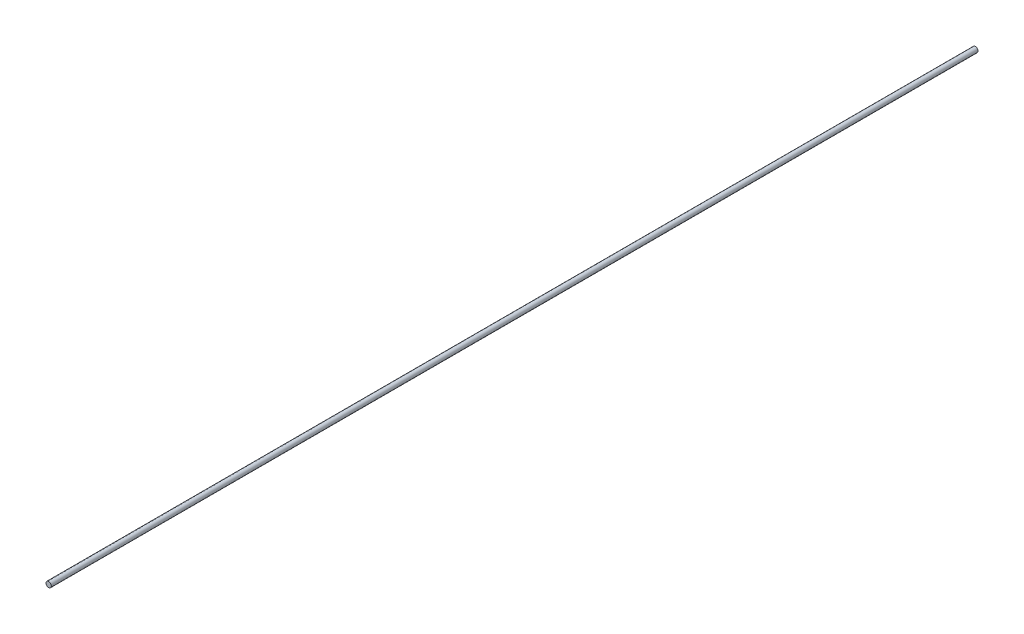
ISO-10303-21;
HEADER;
FILE_DESCRIPTION(('STEP AP214'),'2;1');
FILE_NAME('part.step','',(''),(''),'','','');
FILE_SCHEMA(('AUTOMOTIVE_DESIGN { 1 0 10303 214 1 1 1 1 }'));
ENDSEC;
DATA;
#1=APPLICATION_CONTEXT('core data for automotive mechanical design processes');
#2=APPLICATION_PROTOCOL_DEFINITION('international standard','automotive_design',2000,#1);
#3=PRODUCT_CONTEXT('',#1,'mechanical');
#4=PRODUCT('Part','Part','',(#3));
#5=PRODUCT_RELATED_PRODUCT_CATEGORY('part','',(#4));
#6=PRODUCT_DEFINITION_FORMATION('','',#4);
#7=PRODUCT_DEFINITION_CONTEXT('part definition',#1,'design');
#8=PRODUCT_DEFINITION('design','',#6,#7);
#9=PRODUCT_DEFINITION_SHAPE('','',#8);
#10=(LENGTH_UNIT() NAMED_UNIT(*) SI_UNIT(.MILLI.,.METRE.));
#11=(NAMED_UNIT(*) PLANE_ANGLE_UNIT() SI_UNIT($,.RADIAN.));
#12=(NAMED_UNIT(*) SI_UNIT($,.STERADIAN.) SOLID_ANGLE_UNIT());
#13=UNCERTAINTY_MEASURE_WITH_UNIT(LENGTH_MEASURE(1.E-05),#10,'distance_accuracy_value','');
#14=(GEOMETRIC_REPRESENTATION_CONTEXT(3) GLOBAL_UNCERTAINTY_ASSIGNED_CONTEXT((#13)) GLOBAL_UNIT_ASSIGNED_CONTEXT((#10,
#11,#12)) REPRESENTATION_CONTEXT('',''));
#15=CARTESIAN_POINT('',(0.,0.,0.));
#16=DIRECTION('',(0.,0.,1.));
#17=DIRECTION('',(1.,0.,0.));
#18=AXIS2_PLACEMENT_3D('',#15,#16,#17);
#19=CARTESIAN_POINT('',(0.,0.,700.));
#20=DIRECTION('',(0.,0.,-1.));
#21=DIRECTION('',(-1.,0.,0.));
#22=AXIS2_PLACEMENT_3D('',#19,#20,#21);
#23=CYLINDRICAL_SURFACE('',#22,2.);
#24=CARTESIAN_POINT('',(0.,0.,700.));
#25=DIRECTION('',(0.,0.,1.));
#26=DIRECTION('',(1.,0.,0.));
#27=AXIS2_PLACEMENT_3D('',#24,#25,#26);
#28=CIRCLE('',#27,2.);
#29=CARTESIAN_POINT('',(2.,0.,700.));
#30=VERTEX_POINT('',#29);
#31=EDGE_CURVE('E10',#30,#30,#28,.T.);
#32=ORIENTED_EDGE('',*,*,#31,.F.);
#33=EDGE_LOOP('',(#32));
#34=FACE_BOUND('',#33,.T.);
#35=CARTESIAN_POINT('',(0.,0.,0.));
#36=DIRECTION('',(0.,0.,1.));
#37=DIRECTION('',(1.,0.,0.));
#38=AXIS2_PLACEMENT_3D('',#35,#36,#37);
#39=CIRCLE('',#38,2.);
#40=CARTESIAN_POINT('',(2.,0.,0.));
#41=VERTEX_POINT('',#40);
#42=EDGE_CURVE('E35',#41,#41,#39,.T.);
#43=ORIENTED_EDGE('',*,*,#42,.T.);
#44=EDGE_LOOP('',(#43));
#45=FACE_BOUND('',#44,.T.);
#46=ADVANCED_FACE('F32',(#34,#45),#23,.T.);
#47=CARTESIAN_POINT('',(0.,0.,700.));
#48=DIRECTION('',(0.,0.,1.));
#49=DIRECTION('',(1.,0.,0.));
#50=AXIS2_PLACEMENT_3D('',#47,#48,#49);
#51=PLANE('',#50);
#52=ORIENTED_EDGE('',*,*,#31,.T.);
#53=EDGE_LOOP('',(#52));
#54=FACE_BOUND('',#53,.T.);
#55=ADVANCED_FACE('F47',(#54),#51,.T.);
#56=CARTESIAN_POINT('',(0.,0.,0.));
#57=DIRECTION('',(0.,0.,1.));
#58=DIRECTION('',(1.,0.,0.));
#59=AXIS2_PLACEMENT_3D('',#56,#57,#58);
#60=PLANE('',#59);
#61=ORIENTED_EDGE('',*,*,#42,.F.);
#62=EDGE_LOOP('',(#61));
#63=FACE_BOUND('',#62,.T.);
#64=ADVANCED_FACE('F45',(#63),#60,.F.);
#65=CLOSED_SHELL('',(#46,#55,#64));
#66=MANIFOLD_SOLID_BREP('B2',#65);
#67=ADVANCED_BREP_SHAPE_REPRESENTATION('',(#18,#66),#14);
#68=SHAPE_DEFINITION_REPRESENTATION(#9,#67);
ENDSEC;
END-ISO-10303-21;
